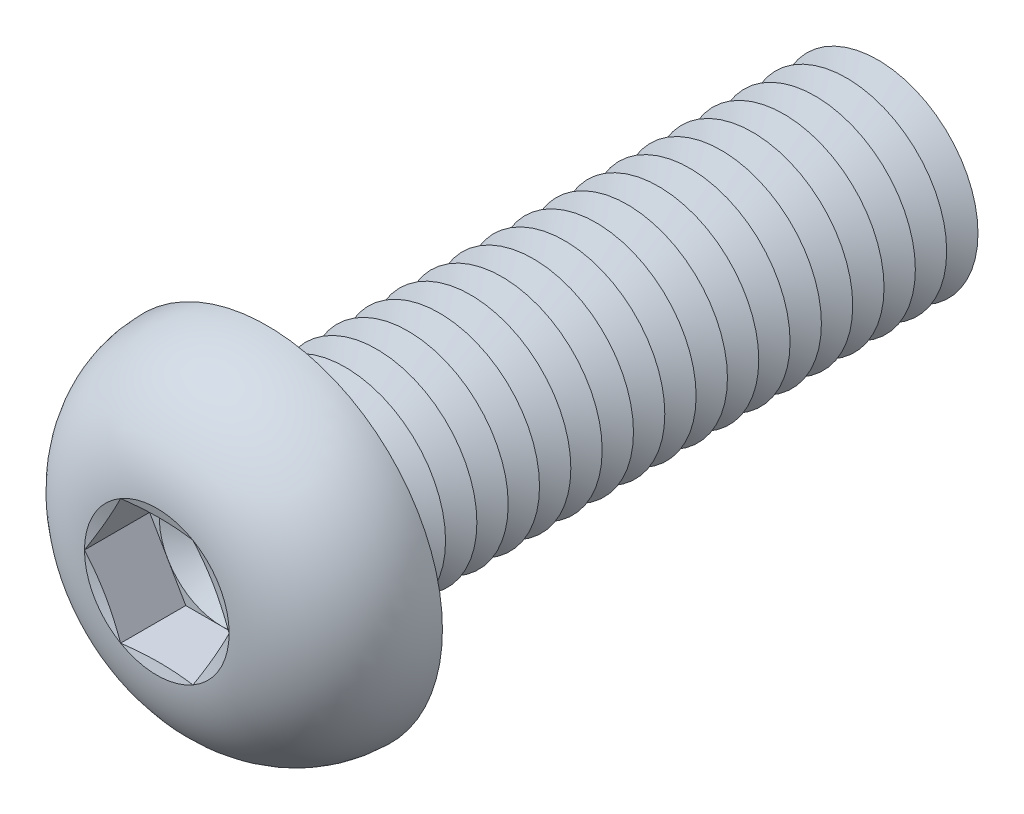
ISO-10303-21;
HEADER;
FILE_DESCRIPTION(('STEP AP214'),'2;1');
FILE_NAME('part.step','',(''),(''),'','','');
FILE_SCHEMA(('AUTOMOTIVE_DESIGN { 1 0 10303 214 1 1 1 1 }'));
ENDSEC;
DATA;
#1=APPLICATION_CONTEXT('core data for automotive mechanical design processes');
#2=APPLICATION_PROTOCOL_DEFINITION('international standard','automotive_design',2000,#1);
#3=PRODUCT_CONTEXT('',#1,'mechanical');
#4=PRODUCT('Part','Part','',(#3));
#5=PRODUCT_RELATED_PRODUCT_CATEGORY('part','',(#4));
#6=PRODUCT_DEFINITION_FORMATION('','',#4);
#7=PRODUCT_DEFINITION_CONTEXT('part definition',#1,'design');
#8=PRODUCT_DEFINITION('design','',#6,#7);
#9=PRODUCT_DEFINITION_SHAPE('','',#8);
#10=(LENGTH_UNIT() NAMED_UNIT(*) SI_UNIT(.MILLI.,.METRE.));
#11=(NAMED_UNIT(*) PLANE_ANGLE_UNIT() SI_UNIT($,.RADIAN.));
#12=(NAMED_UNIT(*) SI_UNIT($,.STERADIAN.) SOLID_ANGLE_UNIT());
#13=UNCERTAINTY_MEASURE_WITH_UNIT(LENGTH_MEASURE(1.E-05),#10,'distance_accuracy_value','');
#14=(GEOMETRIC_REPRESENTATION_CONTEXT(3) GLOBAL_UNCERTAINTY_ASSIGNED_CONTEXT((#13)) GLOBAL_UNIT_ASSIGNED_CONTEXT((#10,
#11,#12)) REPRESENTATION_CONTEXT('',''));
#15=CARTESIAN_POINT('',(0.,0.,0.));
#16=DIRECTION('',(0.,0.,1.));
#17=DIRECTION('',(1.,0.,0.));
#18=AXIS2_PLACEMENT_3D('',#15,#16,#17);
#19=CARTESIAN_POINT('',(0.,0.,1.8));
#20=DIRECTION('',(0.,0.,1.));
#21=DIRECTION('',(1.,0.,0.));
#22=AXIS2_PLACEMENT_3D('',#19,#20,#21);
#23=PLANE('',#22);
#24=CARTESIAN_POINT('',(0.,0.,1.8));
#25=DIRECTION('',(0.,0.,1.));
#26=DIRECTION('',(1.,0.,0.));
#27=AXIS2_PLACEMENT_3D('',#24,#25,#26);
#28=CIRCLE('',#27,2.49999883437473);
#29=CARTESIAN_POINT('',(2.1650625,1.24999941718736,1.8));
#30=VERTEX_POINT('',#29);
#31=CARTESIAN_POINT('',(0.,2.49999883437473,1.8));
#32=VERTEX_POINT('',#31);
#33=EDGE_CURVE('E118',#30,#32,#28,.T.);
#34=ORIENTED_EDGE('',*,*,#33,.F.);
#35=DIRECTION('',(-0.5,0.866025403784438,0.));
#36=VECTOR('',#35,1.);
#37=CARTESIAN_POINT('',(2.88675,0.,1.8));
#38=LINE('',#37,#36);
#39=CARTESIAN_POINT('',(1.443375,2.49999883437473,1.8));
#40=VERTEX_POINT('',#39);
#41=EDGE_CURVE('E125',#30,#40,#38,.T.);
#42=ORIENTED_EDGE('',*,*,#41,.T.);
#43=DIRECTION('',(-1.,0.,0.));
#44=VECTOR('',#43,1.);
#45=CARTESIAN_POINT('',(1.443375,2.49999883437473,1.8));
#46=LINE('',#45,#44);
#47=EDGE_CURVE('E136',#40,#32,#46,.T.);
#48=ORIENTED_EDGE('',*,*,#47,.T.);
#49=EDGE_LOOP('',(#34,#42,#48));
#50=FACE_BOUND('',#49,.T.);
#51=ADVANCED_FACE('F39',(#50),#23,.T.);
#52=CARTESIAN_POINT('',(0.,0.,1.8));
#53=DIRECTION('',(0.,0.,1.));
#54=DIRECTION('',(1.,0.,0.));
#55=AXIS2_PLACEMENT_3D('',#52,#53,#54);
#56=CIRCLE('',#55,2.49999883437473);
#57=CARTESIAN_POINT('',(-2.1650625,1.24999941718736,1.8));
#58=VERTEX_POINT('',#57);
#59=EDGE_CURVE('E11',#32,#58,#56,.T.);
#60=ORIENTED_EDGE('',*,*,#59,.F.);
#61=CARTESIAN_POINT('',(-1.443375,2.49999883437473,1.8));
#62=VERTEX_POINT('',#61);
#63=EDGE_CURVE('E131',#32,#62,#46,.T.);
#64=ORIENTED_EDGE('',*,*,#63,.T.);
#65=DIRECTION('',(-0.5,-0.866025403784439,0.));
#66=VECTOR('',#65,1.);
#67=CARTESIAN_POINT('',(-1.443375,2.49999883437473,1.8));
#68=LINE('',#67,#66);
#69=EDGE_CURVE('E134',#62,#58,#68,.T.);
#70=ORIENTED_EDGE('',*,*,#69,.T.);
#71=EDGE_LOOP('',(#60,#64,#70));
#72=FACE_BOUND('',#71,.T.);
#73=ADVANCED_FACE('F130',(#72),#23,.T.);
#74=CARTESIAN_POINT('',(-2.1650625,-1.24999941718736,1.8));
#75=VERTEX_POINT('',#74);
#76=EDGE_CURVE('E49',#58,#75,#56,.T.);
#77=ORIENTED_EDGE('',*,*,#76,.F.);
#78=CARTESIAN_POINT('',(-2.88675,0.,1.8));
#79=VERTEX_POINT('',#78);
#80=EDGE_CURVE('E143',#58,#79,#68,.T.);
#81=ORIENTED_EDGE('',*,*,#80,.T.);
#82=DIRECTION('',(0.5,-0.866025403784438,0.));
#83=VECTOR('',#82,1.);
#84=CARTESIAN_POINT('',(-2.88675,0.,1.8));
#85=LINE('',#84,#83);
#86=EDGE_CURVE('E151',#79,#75,#85,.T.);
#87=ORIENTED_EDGE('',*,*,#86,.T.);
#88=EDGE_LOOP('',(#77,#81,#87));
#89=FACE_BOUND('',#88,.T.);
#90=ADVANCED_FACE('F426',(#89),#23,.T.);
#91=CARTESIAN_POINT('',(0.,-2.49999883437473,1.8));
#92=VERTEX_POINT('',#91);
#93=EDGE_CURVE('E410',#75,#92,#56,.T.);
#94=ORIENTED_EDGE('',*,*,#93,.F.);
#95=CARTESIAN_POINT('',(-1.443375,-2.49999883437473,1.8));
#96=VERTEX_POINT('',#95);
#97=EDGE_CURVE('E150',#75,#96,#85,.T.);
#98=ORIENTED_EDGE('',*,*,#97,.T.);
#99=DIRECTION('',(1.,0.,0.));
#100=VECTOR('',#99,1.);
#101=CARTESIAN_POINT('',(-1.443375,-2.49999883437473,1.8));
#102=LINE('',#101,#100);
#103=EDGE_CURVE('E156',#96,#92,#102,.T.);
#104=ORIENTED_EDGE('',*,*,#103,.T.);
#105=EDGE_LOOP('',(#94,#98,#104));
#106=FACE_BOUND('',#105,.T.);
#107=ADVANCED_FACE('F419',(#106),#23,.T.);
#108=CARTESIAN_POINT('',(2.1650625,-1.24999941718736,1.8));
#109=VERTEX_POINT('',#108);
#110=EDGE_CURVE('E56',#92,#109,#56,.T.);
#111=ORIENTED_EDGE('',*,*,#110,.F.);
#112=CARTESIAN_POINT('',(1.443375,-2.49999883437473,1.8));
#113=VERTEX_POINT('',#112);
#114=EDGE_CURVE('E155',#92,#113,#102,.T.);
#115=ORIENTED_EDGE('',*,*,#114,.T.);
#116=DIRECTION('',(0.5,0.866025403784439,0.));
#117=VECTOR('',#116,1.);
#118=CARTESIAN_POINT('',(1.443375,-2.49999883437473,1.8));
#119=LINE('',#118,#117);
#120=EDGE_CURVE('E161',#113,#109,#119,.T.);
#121=ORIENTED_EDGE('',*,*,#120,.T.);
#122=EDGE_LOOP('',(#111,#115,#121));
#123=FACE_BOUND('',#122,.T.);
#124=ADVANCED_FACE('F504',(#123),#23,.T.);
#125=CARTESIAN_POINT('',(0.,0.,4.4));
#126=DIRECTION('',(0.,0.,1.));
#127=DIRECTION('',(1.,0.,0.));
#128=AXIS2_PLACEMENT_3D('',#125,#126,#127);
#129=CONICAL_SURFACE('',#128,2.88675,1.30899693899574);
#130=CARTESIAN_POINT('',(2.88686547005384,-0.000199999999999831,4.40003094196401));
#131=CARTESIAN_POINT('',(2.82691617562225,0.103635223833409,4.3839595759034));
#132=CARTESIAN_POINT('',(2.76685817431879,0.207658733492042,4.36936933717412));
#133=CARTESIAN_POINT('',(2.64653003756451,0.416073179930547,4.3437355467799));
#134=CARTESIAN_POINT('',(2.58625982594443,0.520464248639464,4.33269343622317));
#135=CARTESIAN_POINT('',(2.46587274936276,0.728980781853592,4.31480063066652));
#136=CARTESIAN_POINT('',(2.40575669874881,0.833104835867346,4.3079285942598));
#137=CARTESIAN_POINT('',(2.28544792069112,1.0414857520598,4.29871388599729));
#138=CARTESIAN_POINT('',(2.22525521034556,1.14574258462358,4.29637033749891));
#139=CARTESIAN_POINT('',(2.10486978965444,1.35425624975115,4.29637033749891));
#140=CARTESIAN_POINT('',(2.04467707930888,1.45851308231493,4.29871388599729));
#141=CARTESIAN_POINT('',(1.92436830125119,1.66689399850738,4.3079285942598));
#142=CARTESIAN_POINT('',(1.86425225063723,1.77101805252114,4.31480063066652));
#143=CARTESIAN_POINT('',(1.74386517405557,1.97953458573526,4.33269343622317));
#144=CARTESIAN_POINT('',(1.68359496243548,2.08392565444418,4.3437355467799));
#145=CARTESIAN_POINT('',(1.56326682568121,2.29234010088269,4.36936933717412));
#146=CARTESIAN_POINT('',(1.50320882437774,2.39636361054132,4.3839595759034));
#147=CARTESIAN_POINT('',(1.44325952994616,2.50019883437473,4.40003094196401));
#148=B_SPLINE_CURVE_WITH_KNOTS('',3,(#130,#131,#132,#133,#134,#135,#136,#137,#138,#139,#140,
#141,#142,#143,#144,#145,#146,#147),.UNSPECIFIED.,.F.,.F.,(4,2,2,2,2,2,2,2,4),(0.,
0.362931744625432,0.726010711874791,1.08721550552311,1.44835036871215,1.80948523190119,
2.17069002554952,2.53376899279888,2.89670073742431),.UNSPECIFIED.);
#149=CARTESIAN_POINT('',(2.88675,0.,4.4));
#150=VERTEX_POINT('',#149);
#151=CARTESIAN_POINT('',(1.44337499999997,2.49999883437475,4.4));
#152=VERTEX_POINT('',#151);
#153=EDGE_CURVE('E220',#150,#152,#148,.T.);
#154=ORIENTED_EDGE('',*,*,#153,.F.);
#155=CARTESIAN_POINT('',(0.,0.,4.4));
#156=DIRECTION('',(0.,0.,-1.));
#157=DIRECTION('',(-1.,0.,0.));
#158=AXIS2_PLACEMENT_3D('',#155,#156,#157);
#159=CIRCLE('',#158,2.88675);
#160=EDGE_CURVE('E457',#152,#150,#159,.T.);
#161=ORIENTED_EDGE('',*,*,#160,.F.);
#162=EDGE_LOOP('',(#154,#161));
#163=FACE_BOUND('',#162,.T.);
#164=ADVANCED_FACE('F508',(#163),#129,.F.);
#165=CARTESIAN_POINT('',(1.44325952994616,-2.50019883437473,4.40003094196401));
#166=CARTESIAN_POINT('',(1.50320882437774,-2.39636361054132,4.3839595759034));
#167=CARTESIAN_POINT('',(1.56326682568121,-2.29234010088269,4.36936933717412));
#168=CARTESIAN_POINT('',(1.68359496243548,-2.08392565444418,4.3437355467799));
#169=CARTESIAN_POINT('',(1.74386517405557,-1.97953458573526,4.33269343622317));
#170=CARTESIAN_POINT('',(1.86425225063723,-1.77101805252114,4.31480063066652));
#171=CARTESIAN_POINT('',(1.92436830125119,-1.66689399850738,4.3079285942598));
#172=CARTESIAN_POINT('',(2.04467707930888,-1.45851308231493,4.29871388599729));
#173=CARTESIAN_POINT('',(2.10486978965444,-1.35425624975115,4.29637033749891));
#174=CARTESIAN_POINT('',(2.22525521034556,-1.14574258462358,4.29637033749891));
#175=CARTESIAN_POINT('',(2.28544792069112,-1.0414857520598,4.29871388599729));
#176=CARTESIAN_POINT('',(2.40575669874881,-0.833104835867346,4.3079285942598));
#177=CARTESIAN_POINT('',(2.46587274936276,-0.728980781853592,4.31480063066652));
#178=CARTESIAN_POINT('',(2.58625982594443,-0.520464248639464,4.33269343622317));
#179=CARTESIAN_POINT('',(2.64653003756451,-0.416073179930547,4.3437355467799));
#180=CARTESIAN_POINT('',(2.76685817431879,-0.207658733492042,4.36936933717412));
#181=CARTESIAN_POINT('',(2.82691617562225,-0.103635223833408,4.3839595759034));
#182=CARTESIAN_POINT('',(2.88686547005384,0.000200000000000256,4.40003094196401));
#183=B_SPLINE_CURVE_WITH_KNOTS('',3,(#165,#166,#167,#168,#169,#170,#171,#172,#173,#174,#175,
#176,#177,#178,#179,#180,#181,#182),.UNSPECIFIED.,.F.,.F.,(4,2,2,2,2,2,2,2,4),(0.,
0.362931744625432,0.726010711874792,1.08721550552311,1.44835036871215,1.80948523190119,
2.17069002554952,2.53376899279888,2.89670073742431),.UNSPECIFIED.);
#184=CARTESIAN_POINT('',(1.443375,-2.49999883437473,4.4));
#185=VERTEX_POINT('',#184);
#186=EDGE_CURVE('E229',#185,#150,#183,.T.);
#187=ORIENTED_EDGE('',*,*,#186,.F.);
#188=EDGE_CURVE('E458',#150,#185,#159,.T.);
#189=ORIENTED_EDGE('',*,*,#188,.F.);
#190=EDGE_LOOP('',(#187,#189));
#191=FACE_BOUND('',#190,.T.);
#192=ADVANCED_FACE('F514',(#191),#129,.F.);
#193=CARTESIAN_POINT('',(-4.35611719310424,-2.49999883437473,4.97227902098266));
#194=CARTESIAN_POINT('',(-4.25066509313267,-2.49999883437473,4.94777440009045));
#195=CARTESIAN_POINT('',(-4.14516541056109,-2.49999883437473,4.92347459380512));
#196=CARTESIAN_POINT('',(-3.93405094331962,-2.49999883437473,4.87537247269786));
#197=CARTESIAN_POINT('',(-3.82843615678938,-2.49999883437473,4.85157016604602));
#198=CARTESIAN_POINT('',(-3.5113534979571,-2.49999883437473,4.78103338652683));
#199=CARTESIAN_POINT('',(-3.29968815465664,-2.49999883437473,4.73517861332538));
#200=CARTESIAN_POINT('',(-2.87365524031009,-2.49999883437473,4.64645582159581));
#201=CARTESIAN_POINT('',(-2.65928093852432,-2.49999883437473,4.60361983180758));
#202=CARTESIAN_POINT('',(-2.22952626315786,-2.49999883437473,4.52311285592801));
#203=CARTESIAN_POINT('',(-2.01414580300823,-2.49999883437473,4.48544232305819));
#204=CARTESIAN_POINT('',(-1.58798319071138,-2.49999883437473,4.41876559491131));
#205=CARTESIAN_POINT('',(-1.37723418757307,-2.49999883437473,4.38955265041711));
#206=CARTESIAN_POINT('',(-0.954530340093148,-2.49999883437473,4.34171384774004));
#207=CARTESIAN_POINT('',(-0.742575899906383,-2.49999883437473,4.32308463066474));
#208=CARTESIAN_POINT('',(-0.424544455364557,-2.49999883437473,4.30539140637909));
#209=CARTESIAN_POINT('',(-0.318745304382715,-2.49999883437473,4.30120018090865));
#210=CARTESIAN_POINT('',(-0.107062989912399,-2.49999883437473,4.29638997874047));
#211=CARTESIAN_POINT('',(-0.00117982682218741,-2.49999883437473,4.29577098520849));
#212=CARTESIAN_POINT('',(0.210552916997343,-2.49999883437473,4.29814378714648));
#213=CARTESIAN_POINT('',(0.316402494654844,-2.49999883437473,4.30113585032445));
#214=CARTESIAN_POINT('',(0.527944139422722,-2.49999883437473,4.31057322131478));
#215=CARTESIAN_POINT('',(0.633636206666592,-2.49999883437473,4.31701852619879));
#216=CARTESIAN_POINT('',(0.890304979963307,-2.49999883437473,4.33652018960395));
#217=CARTESIAN_POINT('',(1.0411561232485,-2.49999883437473,4.35122885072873));
#218=CARTESIAN_POINT('',(1.34222474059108,-2.49999883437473,4.38593609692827));
#219=CARTESIAN_POINT('',(1.49244223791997,-2.49999883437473,4.40593448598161));
#220=CARTESIAN_POINT('',(1.79273634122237,-2.49999883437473,4.45011321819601));
#221=CARTESIAN_POINT('',(1.94281100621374,-2.49999883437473,4.47430656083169));
#222=CARTESIAN_POINT('',(2.24242097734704,-2.49999883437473,4.52583552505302));
#223=CARTESIAN_POINT('',(2.39195625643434,-2.49999883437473,4.55317130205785));
#224=CARTESIAN_POINT('',(2.69364402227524,-2.49999883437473,4.61079781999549));
#225=CARTESIAN_POINT('',(2.8457870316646,-2.49999883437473,4.64113779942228));
#226=CARTESIAN_POINT('',(3.14969016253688,-2.49999883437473,4.70367638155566));
#227=CARTESIAN_POINT('',(3.30145027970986,-2.49999883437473,4.73587500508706));
#228=CARTESIAN_POINT('',(3.60383766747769,-2.49999883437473,4.80150275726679));
#229=CARTESIAN_POINT('',(3.75446660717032,-2.49999883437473,4.83492423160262));
#230=CARTESIAN_POINT('',(4.05546753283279,-2.49999883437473,4.90285814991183));
#231=CARTESIAN_POINT('',(4.2058395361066,-2.49999883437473,4.9373705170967));
#232=CARTESIAN_POINT('',(4.35611719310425,-2.49999883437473,4.97227902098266));
#233=B_SPLINE_CURVE_WITH_KNOTS('',3,(#193,#194,#195,#196,#197,#198,#199,#200,#201,#202,#203,
#204,#205,#206,#207,#208,#209,#210,#211,#212,#213,#214,#215,#216,#217,#218,#219,#220,#221,#222,
#223,#224,#225,#226,#227,#228,#229,#230,#231,#232),.UNSPECIFIED.,.F.,.F.,(4,2,2,2,2,2,2,2,2,2,2,
2,2,2,2,2,2,2,2,4),(0.,0.324785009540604,0.6495753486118,1.29928181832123,1.95507889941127,
2.61093348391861,3.24905289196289,3.88696967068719,4.204563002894,4.5221548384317,
4.83977022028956,5.15738533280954,5.61196030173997,6.06651842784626,6.52251118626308,
6.97852650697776,7.44392737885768,7.90933346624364,8.37220553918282,8.83504510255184),.UNSPECIFIED.);
#234=CARTESIAN_POINT('',(-1.443375,-2.49999883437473,4.4));
#235=VERTEX_POINT('',#234);
#236=EDGE_CURVE('E438',#235,#185,#233,.T.);
#237=ORIENTED_EDGE('',*,*,#236,.F.);
#238=EDGE_CURVE('E446',#185,#235,#159,.T.);
#239=ORIENTED_EDGE('',*,*,#238,.F.);
#240=EDGE_LOOP('',(#237,#239));
#241=FACE_BOUND('',#240,.T.);
#242=ADVANCED_FACE('F519',(#241),#129,.F.);
#243=CARTESIAN_POINT('',(-2.88686547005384,0.000200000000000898,4.40003094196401));
#244=CARTESIAN_POINT('',(-2.82691617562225,-0.103635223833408,4.3839595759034));
#245=CARTESIAN_POINT('',(-2.76685817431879,-0.207658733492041,4.36936933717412));
#246=CARTESIAN_POINT('',(-2.64653003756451,-0.416073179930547,4.3437355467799));
#247=CARTESIAN_POINT('',(-2.58625982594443,-0.520464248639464,4.33269343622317));
#248=CARTESIAN_POINT('',(-2.46587274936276,-0.728980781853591,4.31480063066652));
#249=CARTESIAN_POINT('',(-2.40575669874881,-0.833104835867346,4.3079285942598));
#250=CARTESIAN_POINT('',(-2.28544792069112,-1.0414857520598,4.29871388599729));
#251=CARTESIAN_POINT('',(-2.22525521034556,-1.14574258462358,4.29637033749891));
#252=CARTESIAN_POINT('',(-2.10486978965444,-1.35425624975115,4.29637033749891));
#253=CARTESIAN_POINT('',(-2.04467707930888,-1.45851308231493,4.29871388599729));
#254=CARTESIAN_POINT('',(-1.92436830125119,-1.66689399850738,4.3079285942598));
#255=CARTESIAN_POINT('',(-1.86425225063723,-1.77101805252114,4.31480063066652));
#256=CARTESIAN_POINT('',(-1.74386517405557,-1.97953458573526,4.33269343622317));
#257=CARTESIAN_POINT('',(-1.68359496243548,-2.08392565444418,4.3437355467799));
#258=CARTESIAN_POINT('',(-1.56326682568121,-2.29234010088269,4.36936933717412));
#259=CARTESIAN_POINT('',(-1.50320882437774,-2.39636361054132,4.3839595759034));
#260=CARTESIAN_POINT('',(-1.44325952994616,-2.50019883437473,4.40003094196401));
#261=B_SPLINE_CURVE_WITH_KNOTS('',3,(#243,#244,#245,#246,#247,#248,#249,#250,#251,#252,#253,
#254,#255,#256,#257,#258,#259,#260),.UNSPECIFIED.,.F.,.F.,(4,2,2,2,2,2,2,2,4),(0.,
0.362931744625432,0.726010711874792,1.08721550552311,1.44835036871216,1.8094852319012,
2.17069002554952,2.53376899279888,2.89670073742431),.UNSPECIFIED.);
#262=CARTESIAN_POINT('',(-2.88675,0.,4.4));
#263=VERTEX_POINT('',#262);
#264=EDGE_CURVE('E431',#263,#235,#261,.T.);
#265=ORIENTED_EDGE('',*,*,#264,.F.);
#266=EDGE_CURVE('E395',#235,#263,#159,.T.);
#267=ORIENTED_EDGE('',*,*,#266,.F.);
#268=EDGE_LOOP('',(#265,#267));
#269=FACE_BOUND('',#268,.T.);
#270=ADVANCED_FACE('F435',(#269),#129,.F.);
#271=CARTESIAN_POINT('',(-1.44325952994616,2.50019883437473,4.40003094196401));
#272=CARTESIAN_POINT('',(-1.50320882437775,2.39636361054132,4.3839595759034));
#273=CARTESIAN_POINT('',(-1.56326682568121,2.29234010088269,4.36936933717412));
#274=CARTESIAN_POINT('',(-1.68359496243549,2.08392565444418,4.3437355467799));
#275=CARTESIAN_POINT('',(-1.74386517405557,1.97953458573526,4.33269343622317));
#276=CARTESIAN_POINT('',(-1.86425225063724,1.77101805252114,4.31480063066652));
#277=CARTESIAN_POINT('',(-1.92436830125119,1.66689399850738,4.3079285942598));
#278=CARTESIAN_POINT('',(-2.04467707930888,1.45851308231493,4.29871388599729));
#279=CARTESIAN_POINT('',(-2.10486978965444,1.35425624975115,4.29637033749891));
#280=CARTESIAN_POINT('',(-2.22525521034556,1.14574258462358,4.29637033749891));
#281=CARTESIAN_POINT('',(-2.28544792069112,1.0414857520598,4.29871388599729));
#282=CARTESIAN_POINT('',(-2.40575669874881,0.833104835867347,4.3079285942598));
#283=CARTESIAN_POINT('',(-2.46587274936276,0.728980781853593,4.31480063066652));
#284=CARTESIAN_POINT('',(-2.58625982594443,0.520464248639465,4.33269343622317));
#285=CARTESIAN_POINT('',(-2.64653003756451,0.416073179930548,4.3437355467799));
#286=CARTESIAN_POINT('',(-2.76685817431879,0.207658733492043,4.36936933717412));
#287=CARTESIAN_POINT('',(-2.82691617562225,0.10363522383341,4.3839595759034));
#288=CARTESIAN_POINT('',(-2.88686547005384,-0.000199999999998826,4.40003094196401));
#289=B_SPLINE_CURVE_WITH_KNOTS('',3,(#271,#272,#273,#274,#275,#276,#277,#278,#279,#280,#281,
#282,#283,#284,#285,#286,#287,#288),.UNSPECIFIED.,.F.,.F.,(4,2,2,2,2,2,2,2,4),(0.,
0.362931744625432,0.726010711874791,1.08721550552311,1.44835036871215,1.80948523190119,
2.17069002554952,2.53376899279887,2.89670073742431),.UNSPECIFIED.);
#290=CARTESIAN_POINT('',(-1.443375,2.49999883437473,4.4));
#291=VERTEX_POINT('',#290);
#292=EDGE_CURVE('E194',#291,#263,#289,.T.);
#293=ORIENTED_EDGE('',*,*,#292,.F.);
#294=EDGE_CURVE('E396',#263,#291,#159,.T.);
#295=ORIENTED_EDGE('',*,*,#294,.F.);
#296=EDGE_LOOP('',(#293,#295));
#297=FACE_BOUND('',#296,.T.);
#298=ADVANCED_FACE('F449',(#297),#129,.F.);
#299=CARTESIAN_POINT('',(0.,0.,-20.625));
#300=DIRECTION('',(0.,0.,1.));
#301=DIRECTION('',(1.,0.,0.));
#302=AXIS2_PLACEMENT_3D('',#299,#300,#301);
#303=CONICAL_SURFACE('',#302,4.00000000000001,1.0471975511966);
#304=CARTESIAN_POINT('',(0.,0.,-21.25));
#305=DIRECTION('',(0.,0.,1.));
#306=DIRECTION('',(1.,0.,0.));
#307=AXIS2_PLACEMENT_3D('',#304,#305,#306);
#308=CIRCLE('',#307,2.91746824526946);
#309=CARTESIAN_POINT('',(2.91746824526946,0.,-21.25));
#310=VERTEX_POINT('',#309);
#311=EDGE_CURVE('E367',#310,#310,#308,.T.);
#312=ORIENTED_EDGE('',*,*,#311,.T.);
#313=EDGE_LOOP('',(#312));
#314=FACE_BOUND('',#313,.T.);
#315=CARTESIAN_POINT('',(0.,0.,-20.625));
#316=DIRECTION('',(0.,0.,1.));
#317=DIRECTION('',(1.,0.,0.));
#318=AXIS2_PLACEMENT_3D('',#315,#316,#317);
#319=CIRCLE('',#318,4.00000000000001);
#320=CARTESIAN_POINT('',(4.00000000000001,0.,-20.625));
#321=VERTEX_POINT('',#320);
#322=EDGE_CURVE('E363',#321,#321,#319,.T.);
#323=ORIENTED_EDGE('',*,*,#322,.F.);
#324=EDGE_LOOP('',(#323));
#325=FACE_BOUND('',#324,.T.);
#326=ADVANCED_FACE('F585',(#314,#325),#303,.T.);
#327=CARTESIAN_POINT('',(0.,0.,-21.25));
#328=DIRECTION('',(0.,0.,-1.));
#329=DIRECTION('',(-1.,0.,0.));
#330=AXIS2_PLACEMENT_3D('',#327,#328,#329);
#331=CONICAL_SURFACE('',#330,2.91746824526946,1.0471975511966);
#332=CARTESIAN_POINT('',(0.,0.,-21.875));
#333=DIRECTION('',(0.,0.,1.));
#334=DIRECTION('',(1.,0.,0.));
#335=AXIS2_PLACEMENT_3D('',#332,#333,#334);
#336=CIRCLE('',#335,4.00000000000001);
#337=CARTESIAN_POINT('',(4.00000000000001,0.,-21.875));
#338=VERTEX_POINT('',#337);
#339=EDGE_CURVE('E371',#338,#338,#336,.T.);
#340=ORIENTED_EDGE('',*,*,#339,.T.);
#341=EDGE_LOOP('',(#340));
#342=FACE_BOUND('',#341,.T.);
#343=ORIENTED_EDGE('',*,*,#311,.F.);
#344=EDGE_LOOP('',(#343));
#345=FACE_BOUND('',#344,.T.);
#346=ADVANCED_FACE('F936',(#342,#345),#331,.T.);
#347=CARTESIAN_POINT('',(0.,4.00000000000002,-25.));
#348=DIRECTION('',(0.,0.,-1.));
#349=DIRECTION('',(-1.,0.,0.));
#350=AXIS2_PLACEMENT_3D('',#347,#348,#349);
#351=PLANE('',#350);
#352=CARTESIAN_POINT('',(0.,0.,-25.));
#353=DIRECTION('',(0.,0.,1.));
#354=DIRECTION('',(1.,0.,0.));
#355=AXIS2_PLACEMENT_3D('',#352,#353,#354);
#356=CIRCLE('',#355,2.91746824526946);
#357=CARTESIAN_POINT('',(2.91746824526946,0.,-25.));
#358=VERTEX_POINT('',#357);
#359=EDGE_CURVE('E391',#358,#358,#356,.T.);
#360=ORIENTED_EDGE('',*,*,#359,.F.);
#361=EDGE_LOOP('',(#360));
#362=FACE_BOUND('',#361,.T.);
#363=ADVANCED_FACE('F930',(#362),#351,.T.);
#364=CARTESIAN_POINT('',(0.,0.,-24.375));
#365=DIRECTION('',(0.,0.,1.));
#366=DIRECTION('',(1.,0.,0.));
#367=AXIS2_PLACEMENT_3D('',#364,#365,#366);
#368=CONICAL_SURFACE('',#367,4.00000000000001,1.0471975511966);
#369=ORIENTED_EDGE('',*,*,#359,.T.);
#370=EDGE_LOOP('',(#369));
#371=FACE_BOUND('',#370,.T.);
#372=CARTESIAN_POINT('',(0.,0.,-24.375));
#373=DIRECTION('',(0.,0.,1.));
#374=DIRECTION('',(1.,0.,0.));
#375=AXIS2_PLACEMENT_3D('',#372,#373,#374);
#376=CIRCLE('',#375,4.00000000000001);
#377=CARTESIAN_POINT('',(4.00000000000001,0.,-24.375));
#378=VERTEX_POINT('',#377);
#379=EDGE_CURVE('E387',#378,#378,#376,.T.);
#380=ORIENTED_EDGE('',*,*,#379,.F.);
#381=EDGE_LOOP('',(#380));
#382=FACE_BOUND('',#381,.T.);
#383=ADVANCED_FACE('F923',(#371,#382),#368,.T.);
#384=CARTESIAN_POINT('',(0.,0.,-23.75));
#385=DIRECTION('',(0.,0.,-1.));
#386=DIRECTION('',(-1.,0.,0.));
#387=AXIS2_PLACEMENT_3D('',#384,#385,#386);
#388=CONICAL_SURFACE('',#387,2.91746824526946,1.0471975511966);
#389=ORIENTED_EDGE('',*,*,#379,.T.);
#390=EDGE_LOOP('',(#389));
#391=FACE_BOUND('',#390,.T.);
#392=CARTESIAN_POINT('',(0.,0.,-23.75));
#393=DIRECTION('',(0.,0.,1.));
#394=DIRECTION('',(1.,0.,0.));
#395=AXIS2_PLACEMENT_3D('',#392,#393,#394);
#396=CIRCLE('',#395,2.91746824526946);
#397=CARTESIAN_POINT('',(2.91746824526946,0.,-23.75));
#398=VERTEX_POINT('',#397);
#399=EDGE_CURVE('E383',#398,#398,#396,.T.);
#400=ORIENTED_EDGE('',*,*,#399,.F.);
#401=EDGE_LOOP('',(#400));
#402=FACE_BOUND('',#401,.T.);
#403=ADVANCED_FACE('F916',(#391,#402),#388,.T.);
#404=CARTESIAN_POINT('',(0.,0.,-23.125));
#405=DIRECTION('',(0.,0.,1.));
#406=DIRECTION('',(1.,0.,0.));
#407=AXIS2_PLACEMENT_3D('',#404,#405,#406);
#408=CONICAL_SURFACE('',#407,4.00000000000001,1.0471975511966);
#409=ORIENTED_EDGE('',*,*,#399,.T.);
#410=EDGE_LOOP('',(#409));
#411=FACE_BOUND('',#410,.T.);
#412=CARTESIAN_POINT('',(0.,0.,-23.125));
#413=DIRECTION('',(0.,0.,1.));
#414=DIRECTION('',(1.,0.,0.));
#415=AXIS2_PLACEMENT_3D('',#412,#413,#414);
#416=CIRCLE('',#415,4.00000000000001);
#417=CARTESIAN_POINT('',(4.00000000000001,0.,-23.125));
#418=VERTEX_POINT('',#417);
#419=EDGE_CURVE('E379',#418,#418,#416,.T.);
#420=ORIENTED_EDGE('',*,*,#419,.F.);
#421=EDGE_LOOP('',(#420));
#422=FACE_BOUND('',#421,.T.);
#423=ADVANCED_FACE('F909',(#411,#422),#408,.T.);
#424=CARTESIAN_POINT('',(0.,0.,-22.5));
#425=DIRECTION('',(0.,0.,-1.));
#426=DIRECTION('',(-1.,0.,0.));
#427=AXIS2_PLACEMENT_3D('',#424,#425,#426);
#428=CONICAL_SURFACE('',#427,2.91746824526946,1.0471975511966);
#429=ORIENTED_EDGE('',*,*,#419,.T.);
#430=EDGE_LOOP('',(#429));
#431=FACE_BOUND('',#430,.T.);
#432=CARTESIAN_POINT('',(0.,0.,-22.5));
#433=DIRECTION('',(0.,0.,1.));
#434=DIRECTION('',(1.,0.,0.));
#435=AXIS2_PLACEMENT_3D('',#432,#433,#434);
#436=CIRCLE('',#435,2.91746824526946);
#437=CARTESIAN_POINT('',(2.91746824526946,0.,-22.5));
#438=VERTEX_POINT('',#437);
#439=EDGE_CURVE('E375',#438,#438,#436,.T.);
#440=ORIENTED_EDGE('',*,*,#439,.F.);
#441=EDGE_LOOP('',(#440));
#442=FACE_BOUND('',#441,.T.);
#443=ADVANCED_FACE('F902',(#431,#442),#428,.T.);
#444=CARTESIAN_POINT('',(0.,0.,-21.875));
#445=DIRECTION('',(0.,0.,1.));
#446=DIRECTION('',(1.,0.,0.));
#447=AXIS2_PLACEMENT_3D('',#444,#445,#446);
#448=CONICAL_SURFACE('',#447,4.00000000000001,1.0471975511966);
#449=ORIENTED_EDGE('',*,*,#439,.T.);
#450=EDGE_LOOP('',(#449));
#451=FACE_BOUND('',#450,.T.);
#452=ORIENTED_EDGE('',*,*,#339,.F.);
#453=EDGE_LOOP('',(#452));
#454=FACE_BOUND('',#453,.T.);
#455=ADVANCED_FACE('F895',(#451,#454),#448,.T.);
#456=CARTESIAN_POINT('',(0.,0.,-19.375));
#457=DIRECTION('',(0.,0.,1.));
#458=DIRECTION('',(1.,0.,0.));
#459=AXIS2_PLACEMENT_3D('',#456,#457,#458);
#460=CONICAL_SURFACE('',#459,4.00000000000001,1.0471975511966);
#461=CARTESIAN_POINT('',(0.,0.,-20.));
#462=DIRECTION('',(0.,0.,1.));
#463=DIRECTION('',(1.,0.,0.));
#464=AXIS2_PLACEMENT_3D('',#461,#462,#463);
#465=CIRCLE('',#464,2.91746824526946);
#466=CARTESIAN_POINT('',(2.91746824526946,0.,-20.));
#467=VERTEX_POINT('',#466);
#468=EDGE_CURVE('E359',#467,#467,#465,.T.);
#469=ORIENTED_EDGE('',*,*,#468,.T.);
#470=EDGE_LOOP('',(#469));
#471=FACE_BOUND('',#470,.T.);
#472=CARTESIAN_POINT('',(0.,0.,-19.375));
#473=DIRECTION('',(0.,0.,1.));
#474=DIRECTION('',(1.,0.,0.));
#475=AXIS2_PLACEMENT_3D('',#472,#473,#474);
#476=CIRCLE('',#475,4.00000000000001);
#477=CARTESIAN_POINT('',(4.00000000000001,0.,-19.375));
#478=VERTEX_POINT('',#477);
#479=EDGE_CURVE('E355',#478,#478,#476,.T.);
#480=ORIENTED_EDGE('',*,*,#479,.F.);
#481=EDGE_LOOP('',(#480));
#482=FACE_BOUND('',#481,.T.);
#483=ADVANCED_FACE('F888',(#471,#482),#460,.T.);
#484=CARTESIAN_POINT('',(0.,0.,-20.));
#485=DIRECTION('',(0.,0.,-1.));
#486=DIRECTION('',(-1.,0.,0.));
#487=AXIS2_PLACEMENT_3D('',#484,#485,#486);
#488=CONICAL_SURFACE('',#487,2.91746824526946,1.0471975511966);
#489=ORIENTED_EDGE('',*,*,#322,.T.);
#490=EDGE_LOOP('',(#489));
#491=FACE_BOUND('',#490,.T.);
#492=ORIENTED_EDGE('',*,*,#468,.F.);
#493=EDGE_LOOP('',(#492));
#494=FACE_BOUND('',#493,.T.);
#495=ADVANCED_FACE('F881',(#491,#494),#488,.T.);
#496=CARTESIAN_POINT('',(0.,0.,-18.125));
#497=DIRECTION('',(0.,0.,1.));
#498=DIRECTION('',(1.,0.,0.));
#499=AXIS2_PLACEMENT_3D('',#496,#497,#498);
#500=CONICAL_SURFACE('',#499,4.00000000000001,1.0471975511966);
#501=CARTESIAN_POINT('',(0.,0.,-18.75));
#502=DIRECTION('',(0.,0.,1.));
#503=DIRECTION('',(1.,0.,0.));
#504=AXIS2_PLACEMENT_3D('',#501,#502,#503);
#505=CIRCLE('',#504,2.91746824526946);
#506=CARTESIAN_POINT('',(2.91746824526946,0.,-18.75));
#507=VERTEX_POINT('',#506);
#508=EDGE_CURVE('E351',#507,#507,#505,.T.);
#509=ORIENTED_EDGE('',*,*,#508,.T.);
#510=EDGE_LOOP('',(#509));
#511=FACE_BOUND('',#510,.T.);
#512=CARTESIAN_POINT('',(0.,0.,-18.125));
#513=DIRECTION('',(0.,0.,1.));
#514=DIRECTION('',(1.,0.,0.));
#515=AXIS2_PLACEMENT_3D('',#512,#513,#514);
#516=CIRCLE('',#515,4.00000000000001);
#517=CARTESIAN_POINT('',(4.00000000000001,0.,-18.125));
#518=VERTEX_POINT('',#517);
#519=EDGE_CURVE('E347',#518,#518,#516,.T.);
#520=ORIENTED_EDGE('',*,*,#519,.F.);
#521=EDGE_LOOP('',(#520));
#522=FACE_BOUND('',#521,.T.);
#523=ADVANCED_FACE('F874',(#511,#522),#500,.T.);
#524=CARTESIAN_POINT('',(0.,0.,-18.75));
#525=DIRECTION('',(0.,0.,-1.));
#526=DIRECTION('',(-1.,0.,0.));
#527=AXIS2_PLACEMENT_3D('',#524,#525,#526);
#528=CONICAL_SURFACE('',#527,2.91746824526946,1.0471975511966);
#529=ORIENTED_EDGE('',*,*,#479,.T.);
#530=EDGE_LOOP('',(#529));
#531=FACE_BOUND('',#530,.T.);
#532=ORIENTED_EDGE('',*,*,#508,.F.);
#533=EDGE_LOOP('',(#532));
#534=FACE_BOUND('',#533,.T.);
#535=ADVANCED_FACE('F867',(#531,#534),#528,.T.);
#536=CARTESIAN_POINT('',(0.,0.,-16.875));
#537=DIRECTION('',(0.,0.,1.));
#538=DIRECTION('',(1.,0.,0.));
#539=AXIS2_PLACEMENT_3D('',#536,#537,#538);
#540=CONICAL_SURFACE('',#539,4.00000000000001,1.0471975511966);
#541=CARTESIAN_POINT('',(0.,0.,-17.5));
#542=DIRECTION('',(0.,0.,1.));
#543=DIRECTION('',(1.,0.,0.));
#544=AXIS2_PLACEMENT_3D('',#541,#542,#543);
#545=CIRCLE('',#544,2.91746824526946);
#546=CARTESIAN_POINT('',(2.91746824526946,0.,-17.5));
#547=VERTEX_POINT('',#546);
#548=EDGE_CURVE('E343',#547,#547,#545,.T.);
#549=ORIENTED_EDGE('',*,*,#548,.T.);
#550=EDGE_LOOP('',(#549));
#551=FACE_BOUND('',#550,.T.);
#552=CARTESIAN_POINT('',(0.,0.,-16.875));
#553=DIRECTION('',(0.,0.,1.));
#554=DIRECTION('',(1.,0.,0.));
#555=AXIS2_PLACEMENT_3D('',#552,#553,#554);
#556=CIRCLE('',#555,4.00000000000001);
#557=CARTESIAN_POINT('',(4.00000000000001,0.,-16.875));
#558=VERTEX_POINT('',#557);
#559=EDGE_CURVE('E339',#558,#558,#556,.T.);
#560=ORIENTED_EDGE('',*,*,#559,.F.);
#561=EDGE_LOOP('',(#560));
#562=FACE_BOUND('',#561,.T.);
#563=ADVANCED_FACE('F860',(#551,#562),#540,.T.);
#564=CARTESIAN_POINT('',(0.,0.,-17.5));
#565=DIRECTION('',(0.,0.,-1.));
#566=DIRECTION('',(-1.,0.,0.));
#567=AXIS2_PLACEMENT_3D('',#564,#565,#566);
#568=CONICAL_SURFACE('',#567,2.91746824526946,1.0471975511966);
#569=ORIENTED_EDGE('',*,*,#519,.T.);
#570=EDGE_LOOP('',(#569));
#571=FACE_BOUND('',#570,.T.);
#572=ORIENTED_EDGE('',*,*,#548,.F.);
#573=EDGE_LOOP('',(#572));
#574=FACE_BOUND('',#573,.T.);
#575=ADVANCED_FACE('F853',(#571,#574),#568,.T.);
#576=CARTESIAN_POINT('',(0.,0.,-15.625));
#577=DIRECTION('',(0.,0.,1.));
#578=DIRECTION('',(1.,0.,0.));
#579=AXIS2_PLACEMENT_3D('',#576,#577,#578);
#580=CONICAL_SURFACE('',#579,4.00000000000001,1.0471975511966);
#581=CARTESIAN_POINT('',(0.,0.,-16.25));
#582=DIRECTION('',(0.,0.,1.));
#583=DIRECTION('',(1.,0.,0.));
#584=AXIS2_PLACEMENT_3D('',#581,#582,#583);
#585=CIRCLE('',#584,2.91746824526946);
#586=CARTESIAN_POINT('',(2.91746824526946,0.,-16.25));
#587=VERTEX_POINT('',#586);
#588=EDGE_CURVE('E335',#587,#587,#585,.T.);
#589=ORIENTED_EDGE('',*,*,#588,.T.);
#590=EDGE_LOOP('',(#589));
#591=FACE_BOUND('',#590,.T.);
#592=CARTESIAN_POINT('',(0.,0.,-15.625));
#593=DIRECTION('',(0.,0.,1.));
#594=DIRECTION('',(1.,0.,0.));
#595=AXIS2_PLACEMENT_3D('',#592,#593,#594);
#596=CIRCLE('',#595,4.00000000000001);
#597=CARTESIAN_POINT('',(4.00000000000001,0.,-15.625));
#598=VERTEX_POINT('',#597);
#599=EDGE_CURVE('E331',#598,#598,#596,.T.);
#600=ORIENTED_EDGE('',*,*,#599,.F.);
#601=EDGE_LOOP('',(#600));
#602=FACE_BOUND('',#601,.T.);
#603=ADVANCED_FACE('F846',(#591,#602),#580,.T.);
#604=CARTESIAN_POINT('',(0.,0.,-16.25));
#605=DIRECTION('',(0.,0.,-1.));
#606=DIRECTION('',(-1.,0.,0.));
#607=AXIS2_PLACEMENT_3D('',#604,#605,#606);
#608=CONICAL_SURFACE('',#607,2.91746824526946,1.0471975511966);
#609=ORIENTED_EDGE('',*,*,#559,.T.);
#610=EDGE_LOOP('',(#609));
#611=FACE_BOUND('',#610,.T.);
#612=ORIENTED_EDGE('',*,*,#588,.F.);
#613=EDGE_LOOP('',(#612));
#614=FACE_BOUND('',#613,.T.);
#615=ADVANCED_FACE('F839',(#611,#614),#608,.T.);
#616=CARTESIAN_POINT('',(0.,0.,-14.375));
#617=DIRECTION('',(0.,0.,1.));
#618=DIRECTION('',(1.,0.,0.));
#619=AXIS2_PLACEMENT_3D('',#616,#617,#618);
#620=CONICAL_SURFACE('',#619,4.00000000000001,1.0471975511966);
#621=CARTESIAN_POINT('',(0.,0.,-15.));
#622=DIRECTION('',(0.,0.,1.));
#623=DIRECTION('',(1.,0.,0.));
#624=AXIS2_PLACEMENT_3D('',#621,#622,#623);
#625=CIRCLE('',#624,2.91746824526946);
#626=CARTESIAN_POINT('',(2.91746824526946,0.,-15.));
#627=VERTEX_POINT('',#626);
#628=EDGE_CURVE('E327',#627,#627,#625,.T.);
#629=ORIENTED_EDGE('',*,*,#628,.T.);
#630=EDGE_LOOP('',(#629));
#631=FACE_BOUND('',#630,.T.);
#632=CARTESIAN_POINT('',(0.,0.,-14.375));
#633=DIRECTION('',(0.,0.,1.));
#634=DIRECTION('',(1.,0.,0.));
#635=AXIS2_PLACEMENT_3D('',#632,#633,#634);
#636=CIRCLE('',#635,4.00000000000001);
#637=CARTESIAN_POINT('',(4.00000000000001,0.,-14.375));
#638=VERTEX_POINT('',#637);
#639=EDGE_CURVE('E323',#638,#638,#636,.T.);
#640=ORIENTED_EDGE('',*,*,#639,.F.);
#641=EDGE_LOOP('',(#640));
#642=FACE_BOUND('',#641,.T.);
#643=ADVANCED_FACE('F832',(#631,#642),#620,.T.);
#644=CARTESIAN_POINT('',(0.,0.,-15.));
#645=DIRECTION('',(0.,0.,-1.));
#646=DIRECTION('',(-1.,0.,0.));
#647=AXIS2_PLACEMENT_3D('',#644,#645,#646);
#648=CONICAL_SURFACE('',#647,2.91746824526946,1.0471975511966);
#649=ORIENTED_EDGE('',*,*,#599,.T.);
#650=EDGE_LOOP('',(#649));
#651=FACE_BOUND('',#650,.T.);
#652=ORIENTED_EDGE('',*,*,#628,.F.);
#653=EDGE_LOOP('',(#652));
#654=FACE_BOUND('',#653,.T.);
#655=ADVANCED_FACE('F825',(#651,#654),#648,.T.);
#656=CARTESIAN_POINT('',(0.,0.,-13.125));
#657=DIRECTION('',(0.,0.,1.));
#658=DIRECTION('',(1.,0.,0.));
#659=AXIS2_PLACEMENT_3D('',#656,#657,#658);
#660=CONICAL_SURFACE('',#659,4.00000000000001,1.0471975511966);
#661=CARTESIAN_POINT('',(0.,0.,-13.75));
#662=DIRECTION('',(0.,0.,1.));
#663=DIRECTION('',(1.,0.,0.));
#664=AXIS2_PLACEMENT_3D('',#661,#662,#663);
#665=CIRCLE('',#664,2.91746824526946);
#666=CARTESIAN_POINT('',(2.91746824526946,0.,-13.75));
#667=VERTEX_POINT('',#666);
#668=EDGE_CURVE('E319',#667,#667,#665,.T.);
#669=ORIENTED_EDGE('',*,*,#668,.T.);
#670=EDGE_LOOP('',(#669));
#671=FACE_BOUND('',#670,.T.);
#672=CARTESIAN_POINT('',(0.,0.,-13.125));
#673=DIRECTION('',(0.,0.,1.));
#674=DIRECTION('',(1.,0.,0.));
#675=AXIS2_PLACEMENT_3D('',#672,#673,#674);
#676=CIRCLE('',#675,4.00000000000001);
#677=CARTESIAN_POINT('',(4.00000000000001,0.,-13.125));
#678=VERTEX_POINT('',#677);
#679=EDGE_CURVE('E315',#678,#678,#676,.T.);
#680=ORIENTED_EDGE('',*,*,#679,.F.);
#681=EDGE_LOOP('',(#680));
#682=FACE_BOUND('',#681,.T.);
#683=ADVANCED_FACE('F818',(#671,#682),#660,.T.);
#684=CARTESIAN_POINT('',(0.,0.,-13.75));
#685=DIRECTION('',(0.,0.,-1.));
#686=DIRECTION('',(-1.,0.,0.));
#687=AXIS2_PLACEMENT_3D('',#684,#685,#686);
#688=CONICAL_SURFACE('',#687,2.91746824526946,1.0471975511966);
#689=ORIENTED_EDGE('',*,*,#639,.T.);
#690=EDGE_LOOP('',(#689));
#691=FACE_BOUND('',#690,.T.);
#692=ORIENTED_EDGE('',*,*,#668,.F.);
#693=EDGE_LOOP('',(#692));
#694=FACE_BOUND('',#693,.T.);
#695=ADVANCED_FACE('F811',(#691,#694),#688,.T.);
#696=CARTESIAN_POINT('',(0.,0.,-11.875));
#697=DIRECTION('',(0.,0.,1.));
#698=DIRECTION('',(1.,0.,0.));
#699=AXIS2_PLACEMENT_3D('',#696,#697,#698);
#700=CONICAL_SURFACE('',#699,4.00000000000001,1.0471975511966);
#701=CARTESIAN_POINT('',(0.,0.,-12.5));
#702=DIRECTION('',(0.,0.,1.));
#703=DIRECTION('',(1.,0.,0.));
#704=AXIS2_PLACEMENT_3D('',#701,#702,#703);
#705=CIRCLE('',#704,2.91746824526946);
#706=CARTESIAN_POINT('',(2.91746824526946,0.,-12.5));
#707=VERTEX_POINT('',#706);
#708=EDGE_CURVE('E311',#707,#707,#705,.T.);
#709=ORIENTED_EDGE('',*,*,#708,.T.);
#710=EDGE_LOOP('',(#709));
#711=FACE_BOUND('',#710,.T.);
#712=CARTESIAN_POINT('',(0.,0.,-11.875));
#713=DIRECTION('',(0.,0.,1.));
#714=DIRECTION('',(1.,0.,0.));
#715=AXIS2_PLACEMENT_3D('',#712,#713,#714);
#716=CIRCLE('',#715,4.00000000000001);
#717=CARTESIAN_POINT('',(4.00000000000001,0.,-11.875));
#718=VERTEX_POINT('',#717);
#719=EDGE_CURVE('E307',#718,#718,#716,.T.);
#720=ORIENTED_EDGE('',*,*,#719,.F.);
#721=EDGE_LOOP('',(#720));
#722=FACE_BOUND('',#721,.T.);
#723=ADVANCED_FACE('F804',(#711,#722),#700,.T.);
#724=CARTESIAN_POINT('',(0.,0.,-12.5));
#725=DIRECTION('',(0.,0.,-1.));
#726=DIRECTION('',(-1.,0.,0.));
#727=AXIS2_PLACEMENT_3D('',#724,#725,#726);
#728=CONICAL_SURFACE('',#727,2.91746824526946,1.0471975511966);
#729=ORIENTED_EDGE('',*,*,#679,.T.);
#730=EDGE_LOOP('',(#729));
#731=FACE_BOUND('',#730,.T.);
#732=ORIENTED_EDGE('',*,*,#708,.F.);
#733=EDGE_LOOP('',(#732));
#734=FACE_BOUND('',#733,.T.);
#735=ADVANCED_FACE('F797',(#731,#734),#728,.T.);
#736=CARTESIAN_POINT('',(0.,0.,-10.625));
#737=DIRECTION('',(0.,0.,1.));
#738=DIRECTION('',(1.,0.,0.));
#739=AXIS2_PLACEMENT_3D('',#736,#737,#738);
#740=CONICAL_SURFACE('',#739,4.00000000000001,1.0471975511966);
#741=CARTESIAN_POINT('',(0.,0.,-11.25));
#742=DIRECTION('',(0.,0.,1.));
#743=DIRECTION('',(1.,0.,0.));
#744=AXIS2_PLACEMENT_3D('',#741,#742,#743);
#745=CIRCLE('',#744,2.91746824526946);
#746=CARTESIAN_POINT('',(2.91746824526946,0.,-11.25));
#747=VERTEX_POINT('',#746);
#748=EDGE_CURVE('E303',#747,#747,#745,.T.);
#749=ORIENTED_EDGE('',*,*,#748,.T.);
#750=EDGE_LOOP('',(#749));
#751=FACE_BOUND('',#750,.T.);
#752=CARTESIAN_POINT('',(0.,0.,-10.625));
#753=DIRECTION('',(0.,0.,1.));
#754=DIRECTION('',(1.,0.,0.));
#755=AXIS2_PLACEMENT_3D('',#752,#753,#754);
#756=CIRCLE('',#755,4.00000000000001);
#757=CARTESIAN_POINT('',(4.00000000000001,0.,-10.625));
#758=VERTEX_POINT('',#757);
#759=EDGE_CURVE('E299',#758,#758,#756,.T.);
#760=ORIENTED_EDGE('',*,*,#759,.F.);
#761=EDGE_LOOP('',(#760));
#762=FACE_BOUND('',#761,.T.);
#763=ADVANCED_FACE('F790',(#751,#762),#740,.T.);
#764=CARTESIAN_POINT('',(0.,0.,-11.25));
#765=DIRECTION('',(0.,0.,-1.));
#766=DIRECTION('',(-1.,0.,0.));
#767=AXIS2_PLACEMENT_3D('',#764,#765,#766);
#768=CONICAL_SURFACE('',#767,2.91746824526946,1.0471975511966);
#769=ORIENTED_EDGE('',*,*,#719,.T.);
#770=EDGE_LOOP('',(#769));
#771=FACE_BOUND('',#770,.T.);
#772=ORIENTED_EDGE('',*,*,#748,.F.);
#773=EDGE_LOOP('',(#772));
#774=FACE_BOUND('',#773,.T.);
#775=ADVANCED_FACE('F783',(#771,#774),#768,.T.);
#776=CARTESIAN_POINT('',(0.,0.,-9.375));
#777=DIRECTION('',(0.,0.,1.));
#778=DIRECTION('',(1.,0.,0.));
#779=AXIS2_PLACEMENT_3D('',#776,#777,#778);
#780=CONICAL_SURFACE('',#779,4.00000000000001,1.0471975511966);
#781=CARTESIAN_POINT('',(0.,0.,-10.));
#782=DIRECTION('',(0.,0.,1.));
#783=DIRECTION('',(1.,0.,0.));
#784=AXIS2_PLACEMENT_3D('',#781,#782,#783);
#785=CIRCLE('',#784,2.91746824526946);
#786=CARTESIAN_POINT('',(2.91746824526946,0.,-10.));
#787=VERTEX_POINT('',#786);
#788=EDGE_CURVE('E295',#787,#787,#785,.T.);
#789=ORIENTED_EDGE('',*,*,#788,.T.);
#790=EDGE_LOOP('',(#789));
#791=FACE_BOUND('',#790,.T.);
#792=CARTESIAN_POINT('',(0.,0.,-9.375));
#793=DIRECTION('',(0.,0.,1.));
#794=DIRECTION('',(1.,0.,0.));
#795=AXIS2_PLACEMENT_3D('',#792,#793,#794);
#796=CIRCLE('',#795,4.00000000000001);
#797=CARTESIAN_POINT('',(4.00000000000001,0.,-9.375));
#798=VERTEX_POINT('',#797);
#799=EDGE_CURVE('E291',#798,#798,#796,.T.);
#800=ORIENTED_EDGE('',*,*,#799,.F.);
#801=EDGE_LOOP('',(#800));
#802=FACE_BOUND('',#801,.T.);
#803=ADVANCED_FACE('F776',(#791,#802),#780,.T.);
#804=CARTESIAN_POINT('',(0.,0.,-10.));
#805=DIRECTION('',(0.,0.,-1.));
#806=DIRECTION('',(-1.,0.,0.));
#807=AXIS2_PLACEMENT_3D('',#804,#805,#806);
#808=CONICAL_SURFACE('',#807,2.91746824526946,1.0471975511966);
#809=ORIENTED_EDGE('',*,*,#759,.T.);
#810=EDGE_LOOP('',(#809));
#811=FACE_BOUND('',#810,.T.);
#812=ORIENTED_EDGE('',*,*,#788,.F.);
#813=EDGE_LOOP('',(#812));
#814=FACE_BOUND('',#813,.T.);
#815=ADVANCED_FACE('F769',(#811,#814),#808,.T.);
#816=CARTESIAN_POINT('',(0.,0.,-8.125));
#817=DIRECTION('',(0.,0.,1.));
#818=DIRECTION('',(1.,0.,0.));
#819=AXIS2_PLACEMENT_3D('',#816,#817,#818);
#820=CONICAL_SURFACE('',#819,4.00000000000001,1.0471975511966);
#821=CARTESIAN_POINT('',(0.,0.,-8.75));
#822=DIRECTION('',(0.,0.,1.));
#823=DIRECTION('',(1.,0.,0.));
#824=AXIS2_PLACEMENT_3D('',#821,#822,#823);
#825=CIRCLE('',#824,2.91746824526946);
#826=CARTESIAN_POINT('',(2.91746824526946,0.,-8.75));
#827=VERTEX_POINT('',#826);
#828=EDGE_CURVE('E287',#827,#827,#825,.T.);
#829=ORIENTED_EDGE('',*,*,#828,.T.);
#830=EDGE_LOOP('',(#829));
#831=FACE_BOUND('',#830,.T.);
#832=CARTESIAN_POINT('',(0.,0.,-8.125));
#833=DIRECTION('',(0.,0.,1.));
#834=DIRECTION('',(1.,0.,0.));
#835=AXIS2_PLACEMENT_3D('',#832,#833,#834);
#836=CIRCLE('',#835,4.00000000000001);
#837=CARTESIAN_POINT('',(4.00000000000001,0.,-8.125));
#838=VERTEX_POINT('',#837);
#839=EDGE_CURVE('E283',#838,#838,#836,.T.);
#840=ORIENTED_EDGE('',*,*,#839,.F.);
#841=EDGE_LOOP('',(#840));
#842=FACE_BOUND('',#841,.T.);
#843=ADVANCED_FACE('F762',(#831,#842),#820,.T.);
#844=CARTESIAN_POINT('',(0.,0.,-8.75));
#845=DIRECTION('',(0.,0.,-1.));
#846=DIRECTION('',(-1.,0.,0.));
#847=AXIS2_PLACEMENT_3D('',#844,#845,#846);
#848=CONICAL_SURFACE('',#847,2.91746824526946,1.0471975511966);
#849=ORIENTED_EDGE('',*,*,#799,.T.);
#850=EDGE_LOOP('',(#849));
#851=FACE_BOUND('',#850,.T.);
#852=ORIENTED_EDGE('',*,*,#828,.F.);
#853=EDGE_LOOP('',(#852));
#854=FACE_BOUND('',#853,.T.);
#855=ADVANCED_FACE('F755',(#851,#854),#848,.T.);
#856=CARTESIAN_POINT('',(0.,0.,-6.875));
#857=DIRECTION('',(0.,0.,1.));
#858=DIRECTION('',(1.,0.,0.));
#859=AXIS2_PLACEMENT_3D('',#856,#857,#858);
#860=CONICAL_SURFACE('',#859,4.00000000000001,1.0471975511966);
#861=CARTESIAN_POINT('',(0.,0.,-7.5));
#862=DIRECTION('',(0.,0.,1.));
#863=DIRECTION('',(1.,0.,0.));
#864=AXIS2_PLACEMENT_3D('',#861,#862,#863);
#865=CIRCLE('',#864,2.91746824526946);
#866=CARTESIAN_POINT('',(2.91746824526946,0.,-7.5));
#867=VERTEX_POINT('',#866);
#868=EDGE_CURVE('E279',#867,#867,#865,.T.);
#869=ORIENTED_EDGE('',*,*,#868,.T.);
#870=EDGE_LOOP('',(#869));
#871=FACE_BOUND('',#870,.T.);
#872=CARTESIAN_POINT('',(0.,0.,-6.875));
#873=DIRECTION('',(0.,0.,1.));
#874=DIRECTION('',(1.,0.,0.));
#875=AXIS2_PLACEMENT_3D('',#872,#873,#874);
#876=CIRCLE('',#875,4.00000000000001);
#877=CARTESIAN_POINT('',(4.00000000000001,0.,-6.875));
#878=VERTEX_POINT('',#877);
#879=EDGE_CURVE('E275',#878,#878,#876,.T.);
#880=ORIENTED_EDGE('',*,*,#879,.F.);
#881=EDGE_LOOP('',(#880));
#882=FACE_BOUND('',#881,.T.);
#883=ADVANCED_FACE('F748',(#871,#882),#860,.T.);
#884=CARTESIAN_POINT('',(0.,0.,-7.5));
#885=DIRECTION('',(0.,0.,-1.));
#886=DIRECTION('',(-1.,0.,0.));
#887=AXIS2_PLACEMENT_3D('',#884,#885,#886);
#888=CONICAL_SURFACE('',#887,2.91746824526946,1.0471975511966);
#889=ORIENTED_EDGE('',*,*,#839,.T.);
#890=EDGE_LOOP('',(#889));
#891=FACE_BOUND('',#890,.T.);
#892=ORIENTED_EDGE('',*,*,#868,.F.);
#893=EDGE_LOOP('',(#892));
#894=FACE_BOUND('',#893,.T.);
#895=ADVANCED_FACE('F741',(#891,#894),#888,.T.);
#896=CARTESIAN_POINT('',(0.,0.,-5.625));
#897=DIRECTION('',(0.,0.,1.));
#898=DIRECTION('',(1.,0.,0.));
#899=AXIS2_PLACEMENT_3D('',#896,#897,#898);
#900=CONICAL_SURFACE('',#899,4.00000000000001,1.0471975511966);
#901=CARTESIAN_POINT('',(0.,0.,-6.25));
#902=DIRECTION('',(0.,0.,1.));
#903=DIRECTION('',(1.,0.,0.));
#904=AXIS2_PLACEMENT_3D('',#901,#902,#903);
#905=CIRCLE('',#904,2.91746824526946);
#906=CARTESIAN_POINT('',(2.91746824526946,0.,-6.25));
#907=VERTEX_POINT('',#906);
#908=EDGE_CURVE('E271',#907,#907,#905,.T.);
#909=ORIENTED_EDGE('',*,*,#908,.T.);
#910=EDGE_LOOP('',(#909));
#911=FACE_BOUND('',#910,.T.);
#912=CARTESIAN_POINT('',(0.,0.,-5.625));
#913=DIRECTION('',(0.,0.,1.));
#914=DIRECTION('',(1.,0.,0.));
#915=AXIS2_PLACEMENT_3D('',#912,#913,#914);
#916=CIRCLE('',#915,4.00000000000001);
#917=CARTESIAN_POINT('',(4.00000000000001,0.,-5.625));
#918=VERTEX_POINT('',#917);
#919=EDGE_CURVE('E267',#918,#918,#916,.T.);
#920=ORIENTED_EDGE('',*,*,#919,.F.);
#921=EDGE_LOOP('',(#920));
#922=FACE_BOUND('',#921,.T.);
#923=ADVANCED_FACE('F734',(#911,#922),#900,.T.);
#924=CARTESIAN_POINT('',(0.,0.,-6.25));
#925=DIRECTION('',(0.,0.,-1.));
#926=DIRECTION('',(-1.,0.,0.));
#927=AXIS2_PLACEMENT_3D('',#924,#925,#926);
#928=CONICAL_SURFACE('',#927,2.91746824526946,1.0471975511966);
#929=ORIENTED_EDGE('',*,*,#879,.T.);
#930=EDGE_LOOP('',(#929));
#931=FACE_BOUND('',#930,.T.);
#932=ORIENTED_EDGE('',*,*,#908,.F.);
#933=EDGE_LOOP('',(#932));
#934=FACE_BOUND('',#933,.T.);
#935=ADVANCED_FACE('F727',(#931,#934),#928,.T.);
#936=CARTESIAN_POINT('',(0.,0.,-4.375));
#937=DIRECTION('',(0.,0.,1.));
#938=DIRECTION('',(1.,0.,0.));
#939=AXIS2_PLACEMENT_3D('',#936,#937,#938);
#940=CONICAL_SURFACE('',#939,4.00000000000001,1.0471975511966);
#941=CARTESIAN_POINT('',(0.,0.,-5.));
#942=DIRECTION('',(0.,0.,1.));
#943=DIRECTION('',(1.,0.,0.));
#944=AXIS2_PLACEMENT_3D('',#941,#942,#943);
#945=CIRCLE('',#944,2.91746824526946);
#946=CARTESIAN_POINT('',(2.91746824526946,0.,-5.));
#947=VERTEX_POINT('',#946);
#948=EDGE_CURVE('E263',#947,#947,#945,.T.);
#949=ORIENTED_EDGE('',*,*,#948,.T.);
#950=EDGE_LOOP('',(#949));
#951=FACE_BOUND('',#950,.T.);
#952=CARTESIAN_POINT('',(0.,0.,-4.375));
#953=DIRECTION('',(0.,0.,1.));
#954=DIRECTION('',(1.,0.,0.));
#955=AXIS2_PLACEMENT_3D('',#952,#953,#954);
#956=CIRCLE('',#955,4.00000000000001);
#957=CARTESIAN_POINT('',(4.00000000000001,0.,-4.375));
#958=VERTEX_POINT('',#957);
#959=EDGE_CURVE('E259',#958,#958,#956,.T.);
#960=ORIENTED_EDGE('',*,*,#959,.F.);
#961=EDGE_LOOP('',(#960));
#962=FACE_BOUND('',#961,.T.);
#963=ADVANCED_FACE('F720',(#951,#962),#940,.T.);
#964=CARTESIAN_POINT('',(0.,0.,-5.));
#965=DIRECTION('',(0.,0.,-1.));
#966=DIRECTION('',(-1.,0.,0.));
#967=AXIS2_PLACEMENT_3D('',#964,#965,#966);
#968=CONICAL_SURFACE('',#967,2.91746824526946,1.0471975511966);
#969=ORIENTED_EDGE('',*,*,#919,.T.);
#970=EDGE_LOOP('',(#969));
#971=FACE_BOUND('',#970,.T.);
#972=ORIENTED_EDGE('',*,*,#948,.F.);
#973=EDGE_LOOP('',(#972));
#974=FACE_BOUND('',#973,.T.);
#975=ADVANCED_FACE('F713',(#971,#974),#968,.T.);
#976=CARTESIAN_POINT('',(0.,0.,-3.125));
#977=DIRECTION('',(0.,0.,1.));
#978=DIRECTION('',(1.,0.,0.));
#979=AXIS2_PLACEMENT_3D('',#976,#977,#978);
#980=CONICAL_SURFACE('',#979,4.00000000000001,1.0471975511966);
#981=CARTESIAN_POINT('',(0.,0.,-3.75));
#982=DIRECTION('',(0.,0.,1.));
#983=DIRECTION('',(1.,0.,0.));
#984=AXIS2_PLACEMENT_3D('',#981,#982,#983);
#985=CIRCLE('',#984,2.91746824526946);
#986=CARTESIAN_POINT('',(2.91746824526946,0.,-3.75));
#987=VERTEX_POINT('',#986);
#988=EDGE_CURVE('E255',#987,#987,#985,.T.);
#989=ORIENTED_EDGE('',*,*,#988,.T.);
#990=EDGE_LOOP('',(#989));
#991=FACE_BOUND('',#990,.T.);
#992=CARTESIAN_POINT('',(0.,0.,-3.125));
#993=DIRECTION('',(0.,0.,1.));
#994=DIRECTION('',(1.,0.,0.));
#995=AXIS2_PLACEMENT_3D('',#992,#993,#994);
#996=CIRCLE('',#995,4.00000000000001);
#997=CARTESIAN_POINT('',(4.00000000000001,0.,-3.125));
#998=VERTEX_POINT('',#997);
#999=EDGE_CURVE('E251',#998,#998,#996,.T.);
#1000=ORIENTED_EDGE('',*,*,#999,.F.);
#1001=EDGE_LOOP('',(#1000));
#1002=FACE_BOUND('',#1001,.T.);
#1003=ADVANCED_FACE('F706',(#991,#1002),#980,.T.);
#1004=CARTESIAN_POINT('',(0.,0.,-3.75));
#1005=DIRECTION('',(0.,0.,-1.));
#1006=DIRECTION('',(-1.,0.,0.));
#1007=AXIS2_PLACEMENT_3D('',#1004,#1005,#1006);
#1008=CONICAL_SURFACE('',#1007,2.91746824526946,1.0471975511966);
#1009=ORIENTED_EDGE('',*,*,#959,.T.);
#1010=EDGE_LOOP('',(#1009));
#1011=FACE_BOUND('',#1010,.T.);
#1012=ORIENTED_EDGE('',*,*,#988,.F.);
#1013=EDGE_LOOP('',(#1012));
#1014=FACE_BOUND('',#1013,.T.);
#1015=ADVANCED_FACE('F699',(#1011,#1014),#1008,.T.);
#1016=CARTESIAN_POINT('',(0.,0.,-1.875));
#1017=DIRECTION('',(0.,0.,1.));
#1018=DIRECTION('',(1.,0.,0.));
#1019=AXIS2_PLACEMENT_3D('',#1016,#1017,#1018);
#1020=CONICAL_SURFACE('',#1019,4.00000000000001,1.0471975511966);
#1021=CARTESIAN_POINT('',(0.,0.,-2.5));
#1022=DIRECTION('',(0.,0.,1.));
#1023=DIRECTION('',(1.,0.,0.));
#1024=AXIS2_PLACEMENT_3D('',#1021,#1022,#1023);
#1025=CIRCLE('',#1024,2.91746824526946);
#1026=CARTESIAN_POINT('',(2.91746824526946,0.,-2.5));
#1027=VERTEX_POINT('',#1026);
#1028=EDGE_CURVE('E247',#1027,#1027,#1025,.T.);
#1029=ORIENTED_EDGE('',*,*,#1028,.T.);
#1030=EDGE_LOOP('',(#1029));
#1031=FACE_BOUND('',#1030,.T.);
#1032=CARTESIAN_POINT('',(0.,0.,-1.875));
#1033=DIRECTION('',(0.,0.,1.));
#1034=DIRECTION('',(1.,0.,0.));
#1035=AXIS2_PLACEMENT_3D('',#1032,#1033,#1034);
#1036=CIRCLE('',#1035,4.00000000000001);
#1037=CARTESIAN_POINT('',(4.00000000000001,0.,-1.875));
#1038=VERTEX_POINT('',#1037);
#1039=EDGE_CURVE('E239',#1038,#1038,#1036,.T.);
#1040=ORIENTED_EDGE('',*,*,#1039,.F.);
#1041=EDGE_LOOP('',(#1040));
#1042=FACE_BOUND('',#1041,.T.);
#1043=ADVANCED_FACE('F692',(#1031,#1042),#1020,.T.);
#1044=CARTESIAN_POINT('',(0.,0.,-2.5));
#1045=DIRECTION('',(0.,0.,-1.));
#1046=DIRECTION('',(-1.,0.,0.));
#1047=AXIS2_PLACEMENT_3D('',#1044,#1045,#1046);
#1048=CONICAL_SURFACE('',#1047,2.91746824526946,1.0471975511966);
#1049=ORIENTED_EDGE('',*,*,#999,.T.);
#1050=EDGE_LOOP('',(#1049));
#1051=FACE_BOUND('',#1050,.T.);
#1052=ORIENTED_EDGE('',*,*,#1028,.F.);
#1053=EDGE_LOOP('',(#1052));
#1054=FACE_BOUND('',#1053,.T.);
#1055=ADVANCED_FACE('F686',(#1051,#1054),#1048,.T.);
#1056=CARTESIAN_POINT('',(0.,0.,-0.625000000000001));
#1057=DIRECTION('',(0.,0.,1.));
#1058=DIRECTION('',(1.,0.,0.));
#1059=AXIS2_PLACEMENT_3D('',#1056,#1057,#1058);
#1060=CONICAL_SURFACE('',#1059,4.00000000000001,1.0471975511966);
#1061=CARTESIAN_POINT('',(0.,0.,-1.25));
#1062=DIRECTION('',(0.,0.,1.));
#1063=DIRECTION('',(1.,0.,0.));
#1064=AXIS2_PLACEMENT_3D('',#1061,#1062,#1063);
#1065=CIRCLE('',#1064,2.91746824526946);
#1066=CARTESIAN_POINT('',(2.91746824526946,0.,-1.25));
#1067=VERTEX_POINT('',#1066);
#1068=EDGE_CURVE('E228',#1067,#1067,#1065,.T.);
#1069=ORIENTED_EDGE('',*,*,#1068,.T.);
#1070=EDGE_LOOP('',(#1069));
#1071=FACE_BOUND('',#1070,.T.);
#1072=CARTESIAN_POINT('',(0.,0.,-0.625000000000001));
#1073=DIRECTION('',(0.,0.,1.));
#1074=DIRECTION('',(1.,0.,0.));
#1075=AXIS2_PLACEMENT_3D('',#1072,#1073,#1074);
#1076=CIRCLE('',#1075,4.00000000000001);
#1077=CARTESIAN_POINT('',(4.00000000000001,0.,-0.625000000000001));
#1078=VERTEX_POINT('',#1077);
#1079=EDGE_CURVE('E243',#1078,#1078,#1076,.T.);
#1080=ORIENTED_EDGE('',*,*,#1079,.F.);
#1081=EDGE_LOOP('',(#1080));
#1082=FACE_BOUND('',#1081,.T.);
#1083=ADVANCED_FACE('F681',(#1071,#1082),#1060,.T.);
#1084=CARTESIAN_POINT('',(0.,0.,-1.25));
#1085=DIRECTION('',(0.,0.,-1.));
#1086=DIRECTION('',(-1.,0.,0.));
#1087=AXIS2_PLACEMENT_3D('',#1084,#1085,#1086);
#1088=CONICAL_SURFACE('',#1087,2.91746824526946,1.0471975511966);
#1089=ORIENTED_EDGE('',*,*,#1039,.T.);
#1090=EDGE_LOOP('',(#1089));
#1091=FACE_BOUND('',#1090,.T.);
#1092=ORIENTED_EDGE('',*,*,#1068,.F.);
#1093=EDGE_LOOP('',(#1092));
#1094=FACE_BOUND('',#1093,.T.);
#1095=ADVANCED_FACE('F217',(#1091,#1094),#1088,.T.);
#1096=CARTESIAN_POINT('',(4.35611719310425,2.49999883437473,4.97227902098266));
#1097=CARTESIAN_POINT('',(4.25066509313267,2.49999883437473,4.94777440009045));
#1098=CARTESIAN_POINT('',(4.14516541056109,2.49999883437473,4.92347459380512));
#1099=CARTESIAN_POINT('',(3.93405094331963,2.49999883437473,4.87537247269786));
#1100=CARTESIAN_POINT('',(3.82843615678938,2.49999883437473,4.85157016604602));
#1101=CARTESIAN_POINT('',(3.5113534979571,2.49999883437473,4.78103338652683));
#1102=CARTESIAN_POINT('',(3.29968815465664,2.49999883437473,4.73517861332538));
#1103=CARTESIAN_POINT('',(2.87365524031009,2.49999883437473,4.64645582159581));
#1104=CARTESIAN_POINT('',(2.65928093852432,2.49999883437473,4.60361983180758));
#1105=CARTESIAN_POINT('',(2.22952626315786,2.49999883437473,4.52311285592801));
#1106=CARTESIAN_POINT('',(2.01414580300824,2.49999883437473,4.48544232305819));
#1107=CARTESIAN_POINT('',(1.58798319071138,2.49999883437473,4.41876559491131));
#1108=CARTESIAN_POINT('',(1.37723418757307,2.49999883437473,4.38955265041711));
#1109=CARTESIAN_POINT('',(0.954530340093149,2.49999883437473,4.34171384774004));
#1110=CARTESIAN_POINT('',(0.742575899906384,2.49999883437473,4.32308463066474));
#1111=CARTESIAN_POINT('',(0.424544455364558,2.49999883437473,4.30539140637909));
#1112=CARTESIAN_POINT('',(0.318745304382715,2.49999883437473,4.30120018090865));
#1113=CARTESIAN_POINT('',(0.1070629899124,2.49999883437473,4.29638997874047));
#1114=CARTESIAN_POINT('',(0.00117982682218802,2.49999883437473,4.29577098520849));
#1115=CARTESIAN_POINT('',(-0.210552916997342,2.49999883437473,4.29814378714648));
#1116=CARTESIAN_POINT('',(-0.316402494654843,2.49999883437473,4.30113585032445));
#1117=CARTESIAN_POINT('',(-0.527944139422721,2.49999883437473,4.31057322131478));
#1118=CARTESIAN_POINT('',(-0.633636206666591,2.49999883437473,4.31701852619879));
#1119=CARTESIAN_POINT('',(-0.890304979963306,2.49999883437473,4.33652018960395));
#1120=CARTESIAN_POINT('',(-1.0411561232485,2.49999883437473,4.35122885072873));
#1121=CARTESIAN_POINT('',(-1.34222474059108,2.49999883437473,4.38593609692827));
#1122=CARTESIAN_POINT('',(-1.49244223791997,2.49999883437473,4.40593448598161));
#1123=CARTESIAN_POINT('',(-1.79273634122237,2.49999883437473,4.45011321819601));
#1124=CARTESIAN_POINT('',(-1.94281100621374,2.49999883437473,4.47430656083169));
#1125=CARTESIAN_POINT('',(-2.24242097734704,2.49999883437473,4.52583552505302));
#1126=CARTESIAN_POINT('',(-2.39195625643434,2.49999883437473,4.55317130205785));
#1127=CARTESIAN_POINT('',(-2.69364402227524,2.49999883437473,4.61079781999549));
#1128=CARTESIAN_POINT('',(-2.8457870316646,2.49999883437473,4.64113779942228));
#1129=CARTESIAN_POINT('',(-3.14969016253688,2.49999883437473,4.70367638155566));
#1130=CARTESIAN_POINT('',(-3.30145027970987,2.49999883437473,4.73587500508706));
#1131=CARTESIAN_POINT('',(-3.60383766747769,2.49999883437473,4.80150275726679));
#1132=CARTESIAN_POINT('',(-3.75446660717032,2.49999883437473,4.83492423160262));
#1133=CARTESIAN_POINT('',(-4.05546753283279,2.49999883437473,4.90285814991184));
#1134=CARTESIAN_POINT('',(-4.2058395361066,2.49999883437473,4.9373705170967));
#1135=CARTESIAN_POINT('',(-4.35611719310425,2.49999883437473,4.97227902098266));
#1136=B_SPLINE_CURVE_WITH_KNOTS('',3,(#1096,#1097,#1098,#1099,#1100,#1101,#1102,#1103,#1104,
#1105,#1106,#1107,#1108,#1109,#1110,#1111,#1112,#1113,#1114,#1115,#1116,#1117,#1118,#1119,#1120,
#1121,#1122,#1123,#1124,#1125,#1126,#1127,#1128,#1129,#1130,#1131,#1132,#1133,#1134,#1135),
.UNSPECIFIED.,.F.,.F.,(4,2,2,2,2,2,2,2,2,2,2,2,2,2,2,2,2,2,2,4),(0.,0.324785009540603,
0.649575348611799,1.29928181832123,1.95507889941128,2.61093348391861,3.24905289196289,
3.88696967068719,4.204563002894,4.5221548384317,4.83977022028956,5.15738533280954,
5.61196030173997,6.06651842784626,6.52251118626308,6.97852650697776,7.44392737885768,
7.90933346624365,8.37220553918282,8.83504510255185),.UNSPECIFIED.);
#1137=EDGE_CURVE('E169',#152,#291,#1136,.T.);
#1138=ORIENTED_EDGE('',*,*,#1137,.F.);
#1139=EDGE_CURVE('E401',#291,#152,#159,.T.);
#1140=ORIENTED_EDGE('',*,*,#1139,.F.);
#1141=EDGE_LOOP('',(#1138,#1140));
#1142=FACE_BOUND('',#1141,.T.);
#1143=ADVANCED_FACE('F201',(#1142),#129,.F.);
#1144=CARTESIAN_POINT('',(0.,0.,0.));
#1145=DIRECTION('',(0.,0.,-1.));
#1146=DIRECTION('',(-1.,0.,0.));
#1147=AXIS2_PLACEMENT_3D('',#1144,#1145,#1146);
#1148=DEGENERATE_TOROIDAL_SURFACE('',#1147,2.59000479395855,4.40999520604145,.T.);
#1149=ORIENTED_EDGE('',*,*,#294,.T.);
#1150=ORIENTED_EDGE('',*,*,#1139,.T.);
#1151=ORIENTED_EDGE('',*,*,#160,.T.);
#1152=ORIENTED_EDGE('',*,*,#188,.T.);
#1153=ORIENTED_EDGE('',*,*,#238,.T.);
#1154=ORIENTED_EDGE('',*,*,#266,.T.);
#1155=EDGE_LOOP('',(#1149,#1150,#1151,#1152,#1153,#1154));
#1156=FACE_BOUND('',#1155,.T.);
#1157=CARTESIAN_POINT('',(0.,0.,0.));
#1158=DIRECTION('',(0.,0.,-1.));
#1159=DIRECTION('',(-1.,0.,0.));
#1160=AXIS2_PLACEMENT_3D('',#1157,#1158,#1159);
#1161=CIRCLE('',#1160,7.);
#1162=CARTESIAN_POINT('',(-7.,0.,0.));
#1163=VERTEX_POINT('',#1162);
#1164=EDGE_CURVE('E400',#1163,#1163,#1161,.T.);
#1165=ORIENTED_EDGE('',*,*,#1164,.F.);
#1166=EDGE_LOOP('',(#1165));
#1167=FACE_BOUND('',#1166,.T.);
#1168=ADVANCED_FACE('F441',(#1156,#1167),#1148,.T.);
#1169=CARTESIAN_POINT('',(0.,4.,0.));
#1170=DIRECTION('',(0.,0.,-1.));
#1171=DIRECTION('',(-1.,0.,0.));
#1172=AXIS2_PLACEMENT_3D('',#1169,#1170,#1171);
#1173=PLANE('',#1172);
#1174=CARTESIAN_POINT('',(0.,0.,0.));
#1175=DIRECTION('',(0.,0.,-1.));
#1176=DIRECTION('',(-1.,0.,0.));
#1177=AXIS2_PLACEMENT_3D('',#1174,#1175,#1176);
#1178=CIRCLE('',#1177,4.62500000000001);
#1179=CARTESIAN_POINT('',(-4.62500000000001,0.,0.));
#1180=VERTEX_POINT('',#1179);
#1181=EDGE_CURVE('E404',#1180,#1180,#1178,.F.);
#1182=ORIENTED_EDGE('',*,*,#1181,.T.);
#1183=EDGE_LOOP('',(#1182));
#1184=FACE_BOUND('',#1183,.T.);
#1185=ORIENTED_EDGE('',*,*,#1164,.T.);
#1186=EDGE_LOOP('',(#1185));
#1187=FACE_BOUND('',#1186,.T.);
#1188=ADVANCED_FACE('F566',(#1184,#1187),#1173,.T.);
#1189=CARTESIAN_POINT('',(0.,0.,-0.625000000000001));
#1190=DIRECTION('',(0.,0.,-1.));
#1191=DIRECTION('',(-1.,0.,0.));
#1192=AXIS2_PLACEMENT_3D('',#1189,#1190,#1191);
#1193=TOROIDAL_SURFACE('',#1192,4.62500000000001,0.625);
#1194=ORIENTED_EDGE('',*,*,#1181,.F.);
#1195=EDGE_LOOP('',(#1194));
#1196=FACE_BOUND('',#1195,.T.);
#1197=ORIENTED_EDGE('',*,*,#1079,.T.);
#1198=EDGE_LOOP('',(#1197));
#1199=FACE_BOUND('',#1198,.T.);
#1200=ADVANCED_FACE('F41',(#1196,#1199),#1193,.F.);
#1201=CARTESIAN_POINT('',(2.88675,0.,1.8));
#1202=DIRECTION('',(0.866025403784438,0.5,0.));
#1203=DIRECTION('',(-0.5,0.866025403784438,0.));
#1204=AXIS2_PLACEMENT_3D('',#1201,#1202,#1203);
#1205=PLANE('',#1204);
#1206=ORIENTED_EDGE('',*,*,#153,.T.);
#1207=DIRECTION('',(0.,0.,1.));
#1208=VECTOR('',#1207,1.);
#1209=CARTESIAN_POINT('',(1.443375,2.49999883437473,1.8));
#1210=LINE('',#1209,#1208);
#1211=EDGE_CURVE('E64',#40,#152,#1210,.T.);
#1212=ORIENTED_EDGE('',*,*,#1211,.F.);
#1213=ORIENTED_EDGE('',*,*,#41,.F.);
#1214=CARTESIAN_POINT('',(2.88675,0.,1.8));
#1215=VERTEX_POINT('',#1214);
#1216=EDGE_CURVE('E140',#1215,#30,#38,.T.);
#1217=ORIENTED_EDGE('',*,*,#1216,.F.);
#1218=DIRECTION('',(0.,0.,1.));
#1219=VECTOR('',#1218,1.);
#1220=CARTESIAN_POINT('',(2.88675,0.,1.8));
#1221=LINE('',#1220,#1219);
#1222=EDGE_CURVE('E165',#1215,#150,#1221,.T.);
#1223=ORIENTED_EDGE('',*,*,#1222,.T.);
#1224=EDGE_LOOP('',(#1206,#1212,#1213,#1217,#1223));
#1225=FACE_BOUND('',#1224,.T.);
#1226=ADVANCED_FACE('F211',(#1225),#1205,.F.);
#1227=CARTESIAN_POINT('',(1.443375,-2.49999883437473,1.8));
#1228=DIRECTION('',(0.866025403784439,-0.5,0.));
#1229=DIRECTION('',(0.5,0.866025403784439,0.));
#1230=AXIS2_PLACEMENT_3D('',#1227,#1228,#1229);
#1231=PLANE('',#1230);
#1232=ORIENTED_EDGE('',*,*,#186,.T.);
#1233=ORIENTED_EDGE('',*,*,#1222,.F.);
#1234=EDGE_CURVE('E160',#109,#1215,#119,.T.);
#1235=ORIENTED_EDGE('',*,*,#1234,.F.);
#1236=ORIENTED_EDGE('',*,*,#120,.F.);
#1237=DIRECTION('',(0.,0.,1.));
#1238=VECTOR('',#1237,1.);
#1239=CARTESIAN_POINT('',(1.443375,-2.49999883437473,1.8));
#1240=LINE('',#1239,#1238);
#1241=EDGE_CURVE('E170',#113,#185,#1240,.T.);
#1242=ORIENTED_EDGE('',*,*,#1241,.T.);
#1243=EDGE_LOOP('',(#1232,#1233,#1235,#1236,#1242));
#1244=FACE_BOUND('',#1243,.T.);
#1245=ADVANCED_FACE('F215',(#1244),#1231,.F.);
#1246=CARTESIAN_POINT('',(-1.443375,-2.49999883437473,1.8));
#1247=DIRECTION('',(0.,-1.,0.));
#1248=DIRECTION('',(1.,0.,0.));
#1249=AXIS2_PLACEMENT_3D('',#1246,#1247,#1248);
#1250=PLANE('',#1249);
#1251=ORIENTED_EDGE('',*,*,#236,.T.);
#1252=ORIENTED_EDGE('',*,*,#1241,.F.);
#1253=ORIENTED_EDGE('',*,*,#114,.F.);
#1254=ORIENTED_EDGE('',*,*,#103,.F.);
#1255=DIRECTION('',(0.,0.,1.));
#1256=VECTOR('',#1255,1.);
#1257=CARTESIAN_POINT('',(-1.443375,-2.49999883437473,1.8));
#1258=LINE('',#1257,#1256);
#1259=EDGE_CURVE('E174',#96,#235,#1258,.T.);
#1260=ORIENTED_EDGE('',*,*,#1259,.T.);
#1261=EDGE_LOOP('',(#1251,#1252,#1253,#1254,#1260));
#1262=FACE_BOUND('',#1261,.T.);
#1263=ADVANCED_FACE('F489',(#1262),#1250,.F.);
#1264=CARTESIAN_POINT('',(-2.88675,0.,1.8));
#1265=DIRECTION('',(-0.866025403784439,-0.5,0.));
#1266=DIRECTION('',(0.5,-0.866025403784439,0.));
#1267=AXIS2_PLACEMENT_3D('',#1264,#1265,#1266);
#1268=PLANE('',#1267);
#1269=ORIENTED_EDGE('',*,*,#264,.T.);
#1270=ORIENTED_EDGE('',*,*,#1259,.F.);
#1271=ORIENTED_EDGE('',*,*,#97,.F.);
#1272=ORIENTED_EDGE('',*,*,#86,.F.);
#1273=DIRECTION('',(0.,0.,1.));
#1274=VECTOR('',#1273,1.);
#1275=CARTESIAN_POINT('',(-2.88675,0.,1.8));
#1276=LINE('',#1275,#1274);
#1277=EDGE_CURVE('E178',#79,#263,#1276,.T.);
#1278=ORIENTED_EDGE('',*,*,#1277,.T.);
#1279=EDGE_LOOP('',(#1269,#1270,#1271,#1272,#1278));
#1280=FACE_BOUND('',#1279,.T.);
#1281=ADVANCED_FACE('F424',(#1280),#1268,.F.);
#1282=CARTESIAN_POINT('',(-1.443375,2.49999883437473,1.8));
#1283=DIRECTION('',(-0.866025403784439,0.5,0.));
#1284=DIRECTION('',(-0.5,-0.866025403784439,0.));
#1285=AXIS2_PLACEMENT_3D('',#1282,#1283,#1284);
#1286=PLANE('',#1285);
#1287=ORIENTED_EDGE('',*,*,#292,.T.);
#1288=ORIENTED_EDGE('',*,*,#1277,.F.);
#1289=ORIENTED_EDGE('',*,*,#80,.F.);
#1290=ORIENTED_EDGE('',*,*,#69,.F.);
#1291=DIRECTION('',(0.,0.,1.));
#1292=VECTOR('',#1291,1.);
#1293=CARTESIAN_POINT('',(-1.443375,2.49999883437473,1.8));
#1294=LINE('',#1293,#1292);
#1295=EDGE_CURVE('E138',#62,#291,#1294,.T.);
#1296=ORIENTED_EDGE('',*,*,#1295,.T.);
#1297=EDGE_LOOP('',(#1287,#1288,#1289,#1290,#1296));
#1298=FACE_BOUND('',#1297,.T.);
#1299=ADVANCED_FACE('F208',(#1298),#1286,.F.);
#1300=CARTESIAN_POINT('',(1.443375,2.49999883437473,1.8));
#1301=DIRECTION('',(0.,1.,0.));
#1302=DIRECTION('',(-1.,0.,0.));
#1303=AXIS2_PLACEMENT_3D('',#1300,#1301,#1302);
#1304=PLANE('',#1303);
#1305=ORIENTED_EDGE('',*,*,#1137,.T.);
#1306=ORIENTED_EDGE('',*,*,#1295,.F.);
#1307=ORIENTED_EDGE('',*,*,#63,.F.);
#1308=ORIENTED_EDGE('',*,*,#47,.F.);
#1309=ORIENTED_EDGE('',*,*,#1211,.T.);
#1310=EDGE_LOOP('',(#1305,#1306,#1307,#1308,#1309));
#1311=FACE_BOUND('',#1310,.T.);
#1312=ADVANCED_FACE('F135',(#1311),#1304,.F.);
#1313=EDGE_CURVE('E43',#109,#30,#56,.T.);
#1314=ORIENTED_EDGE('',*,*,#1313,.F.);
#1315=ORIENTED_EDGE('',*,*,#1234,.T.);
#1316=ORIENTED_EDGE('',*,*,#1216,.T.);
#1317=EDGE_LOOP('',(#1314,#1315,#1316));
#1318=FACE_BOUND('',#1317,.T.);
#1319=ADVANCED_FACE('F115',(#1318),#23,.T.);
#1320=CARTESIAN_POINT('',(0.,0.,1.8));
#1321=DIRECTION('',(0.,0.,1.));
#1322=DIRECTION('',(1.,0.,0.));
#1323=AXIS2_PLACEMENT_3D('',#1320,#1321,#1322);
#1324=CONICAL_SURFACE('',#1323,2.49999883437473,1.0471975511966);
#1325=CARTESIAN_POINT('',(0.,0.,0.35662500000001));
#1326=VERTEX_POINT('',#1325);
#1327=VERTEX_LOOP('',#1326);
#1328=FACE_BOUND('',#1327,.T.);
#1329=ORIENTED_EDGE('',*,*,#33,.T.);
#1330=ORIENTED_EDGE('',*,*,#59,.T.);
#1331=ORIENTED_EDGE('',*,*,#76,.T.);
#1332=ORIENTED_EDGE('',*,*,#93,.T.);
#1333=ORIENTED_EDGE('',*,*,#110,.T.);
#1334=ORIENTED_EDGE('',*,*,#1313,.T.);
#1335=EDGE_LOOP('',(#1329,#1330,#1331,#1332,#1333,#1334));
#1336=FACE_BOUND('',#1335,.T.);
#1337=ADVANCED_FACE('F113',(#1328,#1336),#1324,.F.);
#1338=CLOSED_SHELL('',(#51,#73,#90,#107,#124,#164,#192,#242,#270,#298,#326,#346,#363,#383,#403,
#423,#443,#455,#483,#495,#523,#535,#563,#575,#603,#615,#643,#655,#683,#695,#723,#735,#763,#775,
#803,#815,#843,#855,#883,#895,#923,#935,#963,#975,#1003,#1015,#1043,#1055,#1083,#1095,#1143,
#1168,#1188,#1200,#1226,#1245,#1263,#1281,#1299,#1312,#1319,#1337));
#1339=MANIFOLD_SOLID_BREP('B2',#1338);
#1340=ADVANCED_BREP_SHAPE_REPRESENTATION('',(#18,#1339),#14);
#1341=SHAPE_DEFINITION_REPRESENTATION(#9,#1340);
ENDSEC;
END-ISO-10303-21;
